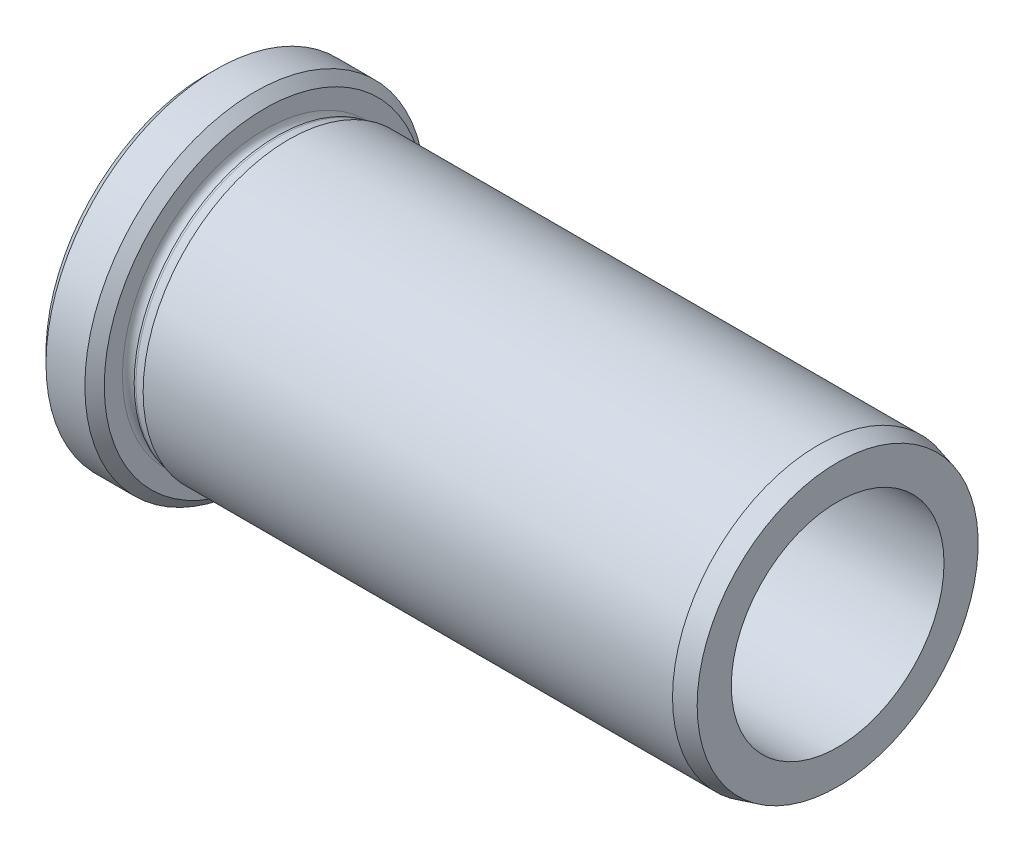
ISO-10303-21;
HEADER;
FILE_DESCRIPTION(('STEP AP214'),'2;1');
FILE_NAME('part.step','',(''),(''),'','','');
FILE_SCHEMA(('AUTOMOTIVE_DESIGN { 1 0 10303 214 1 1 1 1 }'));
ENDSEC;
DATA;
#1=APPLICATION_CONTEXT('core data for automotive mechanical design processes');
#2=APPLICATION_PROTOCOL_DEFINITION('international standard','automotive_design',2000,#1);
#3=PRODUCT_CONTEXT('',#1,'mechanical');
#4=PRODUCT('Part','Part','',(#3));
#5=PRODUCT_RELATED_PRODUCT_CATEGORY('part','',(#4));
#6=PRODUCT_DEFINITION_FORMATION('','',#4);
#7=PRODUCT_DEFINITION_CONTEXT('part definition',#1,'design');
#8=PRODUCT_DEFINITION('design','',#6,#7);
#9=PRODUCT_DEFINITION_SHAPE('','',#8);
#10=(LENGTH_UNIT() NAMED_UNIT(*) SI_UNIT(.MILLI.,.METRE.));
#11=(NAMED_UNIT(*) PLANE_ANGLE_UNIT() SI_UNIT($,.RADIAN.));
#12=(NAMED_UNIT(*) SI_UNIT($,.STERADIAN.) SOLID_ANGLE_UNIT());
#13=UNCERTAINTY_MEASURE_WITH_UNIT(LENGTH_MEASURE(1.E-05),#10,'distance_accuracy_value','');
#14=(GEOMETRIC_REPRESENTATION_CONTEXT(3) GLOBAL_UNCERTAINTY_ASSIGNED_CONTEXT((#13)) GLOBAL_UNIT_ASSIGNED_CONTEXT((#10,
#11,#12)) REPRESENTATION_CONTEXT('',''));
#15=CARTESIAN_POINT('',(0.,0.,0.));
#16=DIRECTION('',(0.,0.,1.));
#17=DIRECTION('',(1.,0.,0.));
#18=AXIS2_PLACEMENT_3D('',#15,#16,#17);
#19=CARTESIAN_POINT('',(30.9097582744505,10.95,0.));
#20=DIRECTION('',(1.,0.,0.));
#21=DIRECTION('',(0.,0.,-1.));
#22=AXIS2_PLACEMENT_3D('',#19,#20,#21);
#23=PLANE('',#22);
#24=CARTESIAN_POINT('',(30.9097582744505,0.,0.));
#25=DIRECTION('',(-1.,0.,0.));
#26=DIRECTION('',(0.,0.,1.));
#27=AXIS2_PLACEMENT_3D('',#24,#25,#26);
#28=CIRCLE('',#27,10.95);
#29=CARTESIAN_POINT('',(30.9097582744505,0.,10.95));
#30=VERTEX_POINT('',#29);
#31=EDGE_CURVE('E40',#30,#30,#28,.T.);
#32=ORIENTED_EDGE('',*,*,#31,.F.);
#33=EDGE_LOOP('',(#32));
#34=FACE_BOUND('',#33,.T.);
#35=CARTESIAN_POINT('',(30.9097582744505,0.,0.));
#36=DIRECTION('',(-1.,0.,0.));
#37=DIRECTION('',(0.,0.,1.));
#38=AXIS2_PLACEMENT_3D('',#35,#36,#37);
#39=CIRCLE('',#38,11.);
#40=CARTESIAN_POINT('',(30.9097582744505,0.,11.));
#41=VERTEX_POINT('',#40);
#42=EDGE_CURVE('E67',#41,#41,#39,.T.);
#43=ORIENTED_EDGE('',*,*,#42,.T.);
#44=EDGE_LOOP('',(#43));
#45=FACE_BOUND('',#44,.T.);
#46=ADVANCED_FACE('F14',(#34,#45),#23,.F.);
#47=CARTESIAN_POINT('',(0.,0.,0.));
#48=DIRECTION('',(-1.,0.,0.));
#49=DIRECTION('',(0.,0.,1.));
#50=AXIS2_PLACEMENT_3D('',#47,#48,#49);
#51=CYLINDRICAL_SURFACE('',#50,10.95);
#52=CARTESIAN_POINT('',(85.9097582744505,0.,0.));
#53=DIRECTION('',(-1.,0.,0.));
#54=DIRECTION('',(0.,0.,1.));
#55=AXIS2_PLACEMENT_3D('',#52,#53,#54);
#56=CIRCLE('',#55,10.95);
#57=CARTESIAN_POINT('',(85.9097582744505,0.,10.95));
#58=VERTEX_POINT('',#57);
#59=EDGE_CURVE('E43',#58,#58,#56,.T.);
#60=ORIENTED_EDGE('',*,*,#59,.F.);
#61=EDGE_LOOP('',(#60));
#62=FACE_BOUND('',#61,.T.);
#63=ORIENTED_EDGE('',*,*,#31,.T.);
#64=EDGE_LOOP('',(#63));
#65=FACE_BOUND('',#64,.T.);
#66=ADVANCED_FACE('F91',(#62,#65),#51,.F.);
#67=CARTESIAN_POINT('',(85.9097582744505,14.4641016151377,0.));
#68=DIRECTION('',(-1.,0.,0.));
#69=DIRECTION('',(0.,0.,1.));
#70=AXIS2_PLACEMENT_3D('',#67,#68,#69);
#71=PLANE('',#70);
#72=CARTESIAN_POINT('',(85.9097582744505,0.,0.));
#73=DIRECTION('',(-1.,0.,0.));
#74=DIRECTION('',(0.,0.,1.));
#75=AXIS2_PLACEMENT_3D('',#72,#73,#74);
#76=CIRCLE('',#75,14.4641016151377);
#77=CARTESIAN_POINT('',(85.9097582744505,0.,14.4641016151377));
#78=VERTEX_POINT('',#77);
#79=EDGE_CURVE('E46',#78,#78,#76,.T.);
#80=ORIENTED_EDGE('',*,*,#79,.F.);
#81=EDGE_LOOP('',(#80));
#82=FACE_BOUND('',#81,.T.);
#83=ORIENTED_EDGE('',*,*,#59,.T.);
#84=EDGE_LOOP('',(#83));
#85=FACE_BOUND('',#84,.T.);
#86=ADVANCED_FACE('F98',(#82,#85),#71,.F.);
#87=CARTESIAN_POINT('',(85.9097582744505,0.,0.));
#88=DIRECTION('',(-1.,0.,0.));
#89=DIRECTION('',(0.,0.,1.));
#90=AXIS2_PLACEMENT_3D('',#87,#88,#89);
#91=CONICAL_SURFACE('',#90,14.4641016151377,0.261799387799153);
#92=CARTESIAN_POINT('',(83.9097582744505,0.,0.));
#93=DIRECTION('',(-1.,0.,0.));
#94=DIRECTION('',(0.,0.,1.));
#95=AXIS2_PLACEMENT_3D('',#92,#93,#94);
#96=CIRCLE('',#95,15.);
#97=CARTESIAN_POINT('',(83.9097582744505,0.,15.));
#98=VERTEX_POINT('',#97);
#99=EDGE_CURVE('E49',#98,#98,#96,.T.);
#100=ORIENTED_EDGE('',*,*,#99,.F.);
#101=EDGE_LOOP('',(#100));
#102=FACE_BOUND('',#101,.T.);
#103=ORIENTED_EDGE('',*,*,#79,.T.);
#104=EDGE_LOOP('',(#103));
#105=FACE_BOUND('',#104,.T.);
#106=ADVANCED_FACE('F196',(#102,#105),#91,.T.);
#107=CARTESIAN_POINT('',(0.,0.,0.));
#108=DIRECTION('',(-1.,0.,0.));
#109=DIRECTION('',(0.,0.,1.));
#110=AXIS2_PLACEMENT_3D('',#107,#108,#109);
#111=CYLINDRICAL_SURFACE('',#110,15.);
#112=CARTESIAN_POINT('',(29.4097582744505,0.,0.));
#113=DIRECTION('',(-1.,0.,0.));
#114=DIRECTION('',(0.,0.,1.));
#115=AXIS2_PLACEMENT_3D('',#112,#113,#114);
#116=CIRCLE('',#115,15.);
#117=CARTESIAN_POINT('',(29.4097582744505,0.,15.));
#118=VERTEX_POINT('',#117);
#119=EDGE_CURVE('E52',#118,#118,#116,.T.);
#120=ORIENTED_EDGE('',*,*,#119,.F.);
#121=EDGE_LOOP('',(#120));
#122=FACE_BOUND('',#121,.T.);
#123=ORIENTED_EDGE('',*,*,#99,.T.);
#124=EDGE_LOOP('',(#123));
#125=FACE_BOUND('',#124,.T.);
#126=ADVANCED_FACE('F186',(#122,#125),#111,.T.);
#127=CARTESIAN_POINT('',(29.4097582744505,0.,0.));
#128=DIRECTION('',(1.,0.,0.));
#129=DIRECTION('',(0.,0.,-1.));
#130=AXIS2_PLACEMENT_3D('',#127,#128,#129);
#131=CONICAL_SURFACE('',#130,15.,0.261799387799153);
#132=CARTESIAN_POINT('',(28.3918762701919,0.,0.));
#133=DIRECTION('',(-1.,0.,0.));
#134=DIRECTION('',(0.,0.,1.));
#135=AXIS2_PLACEMENT_3D('',#132,#133,#134);
#136=CIRCLE('',#135,14.7272593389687);
#137=CARTESIAN_POINT('',(28.3918762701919,0.,14.7272593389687));
#138=VERTEX_POINT('',#137);
#139=EDGE_CURVE('E55',#138,#138,#136,.T.);
#140=ORIENTED_EDGE('',*,*,#139,.F.);
#141=EDGE_LOOP('',(#140));
#142=FACE_BOUND('',#141,.T.);
#143=ORIENTED_EDGE('',*,*,#119,.T.);
#144=EDGE_LOOP('',(#143));
#145=FACE_BOUND('',#144,.T.);
#146=ADVANCED_FACE('F176',(#142,#145),#131,.T.);
#147=CARTESIAN_POINT('',(28.1848210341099,0.,0.));
#148=DIRECTION('',(-1.,0.,0.));
#149=DIRECTION('',(0.,0.,1.));
#150=AXIS2_PLACEMENT_3D('',#147,#148,#149);
#151=TOROIDAL_SURFACE('',#150,15.5,0.8);
#152=CARTESIAN_POINT('',(28.1848210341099,0.,0.));
#153=DIRECTION('',(-1.,0.,0.));
#154=DIRECTION('',(0.,0.,1.));
#155=AXIS2_PLACEMENT_3D('',#152,#153,#154);
#156=CIRCLE('',#155,14.7);
#157=CARTESIAN_POINT('',(28.1848210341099,0.,14.7));
#158=VERTEX_POINT('',#157);
#159=EDGE_CURVE('E58',#158,#158,#156,.T.);
#160=ORIENTED_EDGE('',*,*,#159,.F.);
#161=EDGE_LOOP('',(#160));
#162=FACE_BOUND('',#161,.T.);
#163=ORIENTED_EDGE('',*,*,#139,.T.);
#164=EDGE_LOOP('',(#163));
#165=FACE_BOUND('',#164,.T.);
#166=ADVANCED_FACE('F166',(#162,#165),#151,.F.);
#167=CARTESIAN_POINT('',(0.,0.,0.));
#168=DIRECTION('',(-1.,0.,0.));
#169=DIRECTION('',(0.,0.,1.));
#170=AXIS2_PLACEMENT_3D('',#167,#168,#169);
#171=CYLINDRICAL_SURFACE('',#170,14.7);
#172=CARTESIAN_POINT('',(28.5066259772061,0.,0.));
#173=DIRECTION('',(-1.,0.,0.));
#174=DIRECTION('',(0.,0.,1.));
#175=AXIS2_PLACEMENT_3D('',#172,#173,#174);
#176=CIRCLE('',#175,14.7);
#177=CARTESIAN_POINT('',(28.5066259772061,0.,14.7));
#178=VERTEX_POINT('',#177);
#179=EDGE_CURVE('E61',#178,#178,#176,.T.);
#180=ORIENTED_EDGE('',*,*,#179,.F.);
#181=EDGE_LOOP('',(#180));
#182=FACE_BOUND('',#181,.T.);
#183=ORIENTED_EDGE('',*,*,#159,.T.);
#184=EDGE_LOOP('',(#183));
#185=FACE_BOUND('',#184,.T.);
#186=ADVANCED_FACE('F156',(#182,#185),#171,.F.);
#187=CARTESIAN_POINT('',(27.7097582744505,0.,0.));
#188=DIRECTION('',(-1.,0.,0.));
#189=DIRECTION('',(0.,0.,1.));
#190=AXIS2_PLACEMENT_3D('',#187,#188,#189);
#191=TOROIDAL_SURFACE('',#190,14.6292761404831,0.8);
#192=CARTESIAN_POINT('',(26.9097582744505,0.,0.));
#193=DIRECTION('',(-1.,0.,0.));
#194=DIRECTION('',(0.,0.,1.));
#195=AXIS2_PLACEMENT_3D('',#192,#193,#194);
#196=CIRCLE('',#195,14.6292761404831);
#197=CARTESIAN_POINT('',(26.9097582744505,0.,14.6292761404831));
#198=VERTEX_POINT('',#197);
#199=EDGE_CURVE('E64',#198,#198,#196,.T.);
#200=ORIENTED_EDGE('',*,*,#199,.F.);
#201=EDGE_LOOP('',(#200));
#202=FACE_BOUND('',#201,.T.);
#203=ORIENTED_EDGE('',*,*,#179,.T.);
#204=EDGE_LOOP('',(#203));
#205=FACE_BOUND('',#204,.T.);
#206=ADVANCED_FACE('F147',(#202,#205),#191,.F.);
#207=CARTESIAN_POINT('',(26.9097582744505,17.5,0.));
#208=DIRECTION('',(-1.,0.,0.));
#209=DIRECTION('',(0.,0.,1.));
#210=AXIS2_PLACEMENT_3D('',#207,#208,#209);
#211=PLANE('',#210);
#212=CARTESIAN_POINT('',(26.9097582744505,0.,0.));
#213=DIRECTION('',(-1.,0.,0.));
#214=DIRECTION('',(0.,0.,1.));
#215=AXIS2_PLACEMENT_3D('',#212,#213,#214);
#216=CIRCLE('',#215,16.5);
#217=CARTESIAN_POINT('',(26.9097582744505,0.,16.5));
#218=VERTEX_POINT('',#217);
#219=EDGE_CURVE('E9',#218,#218,#216,.F.);
#220=ORIENTED_EDGE('',*,*,#219,.T.);
#221=EDGE_LOOP('',(#220));
#222=FACE_BOUND('',#221,.T.);
#223=ORIENTED_EDGE('',*,*,#199,.T.);
#224=EDGE_LOOP('',(#223));
#225=FACE_BOUND('',#224,.T.);
#226=ADVANCED_FACE('F137',(#222,#225),#211,.F.);
#227=CARTESIAN_POINT('',(0.,0.,0.));
#228=DIRECTION('',(-1.,0.,0.));
#229=DIRECTION('',(0.,0.,1.));
#230=AXIS2_PLACEMENT_3D('',#227,#228,#229);
#231=CYLINDRICAL_SURFACE('',#230,17.5);
#232=CARTESIAN_POINT('',(25.9097582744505,0.,0.));
#233=DIRECTION('',(-1.,0.,0.));
#234=DIRECTION('',(0.,0.,1.));
#235=AXIS2_PLACEMENT_3D('',#232,#233,#234);
#236=CIRCLE('',#235,17.5);
#237=CARTESIAN_POINT('',(25.9097582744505,0.,17.5));
#238=VERTEX_POINT('',#237);
#239=EDGE_CURVE('E21',#238,#238,#236,.T.);
#240=ORIENTED_EDGE('',*,*,#239,.T.);
#241=EDGE_LOOP('',(#240));
#242=FACE_BOUND('',#241,.T.);
#243=CARTESIAN_POINT('',(21.9097582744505,0.,0.));
#244=DIRECTION('',(1.,0.,0.));
#245=DIRECTION('',(0.,0.,-1.));
#246=AXIS2_PLACEMENT_3D('',#243,#244,#245);
#247=CIRCLE('',#246,17.5);
#248=CARTESIAN_POINT('',(21.9097582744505,0.,-17.5));
#249=VERTEX_POINT('',#248);
#250=EDGE_CURVE('E34',#249,#249,#247,.T.);
#251=ORIENTED_EDGE('',*,*,#250,.T.);
#252=EDGE_LOOP('',(#251));
#253=FACE_BOUND('',#252,.T.);
#254=ADVANCED_FACE('F87',(#242,#253),#231,.T.);
#255=CARTESIAN_POINT('',(20.9097582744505,17.5,0.));
#256=DIRECTION('',(1.,0.,0.));
#257=DIRECTION('',(0.,0.,-1.));
#258=AXIS2_PLACEMENT_3D('',#255,#256,#257);
#259=PLANE('',#258);
#260=CARTESIAN_POINT('',(20.9097582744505,0.,0.));
#261=DIRECTION('',(1.,0.,0.));
#262=DIRECTION('',(0.,0.,-1.));
#263=AXIS2_PLACEMENT_3D('',#260,#261,#262);
#264=CIRCLE('',#263,12.5);
#265=CARTESIAN_POINT('',(20.9097582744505,0.,-12.5));
#266=VERTEX_POINT('',#265);
#267=EDGE_CURVE('E25',#266,#266,#264,.T.);
#268=ORIENTED_EDGE('',*,*,#267,.T.);
#269=EDGE_LOOP('',(#268));
#270=FACE_BOUND('',#269,.T.);
#271=CARTESIAN_POINT('',(20.9097582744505,0.,0.));
#272=DIRECTION('',(1.,0.,0.));
#273=DIRECTION('',(0.,0.,-1.));
#274=AXIS2_PLACEMENT_3D('',#271,#272,#273);
#275=CIRCLE('',#274,16.5);
#276=CARTESIAN_POINT('',(20.9097582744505,0.,-16.5));
#277=VERTEX_POINT('',#276);
#278=EDGE_CURVE('E37',#277,#277,#275,.F.);
#279=ORIENTED_EDGE('',*,*,#278,.T.);
#280=EDGE_LOOP('',(#279));
#281=FACE_BOUND('',#280,.T.);
#282=ADVANCED_FACE('F75',(#270,#281),#259,.F.);
#283=CARTESIAN_POINT('',(0.,0.,0.));
#284=DIRECTION('',(-1.,0.,0.));
#285=DIRECTION('',(0.,0.,1.));
#286=AXIS2_PLACEMENT_3D('',#283,#284,#285);
#287=CYLINDRICAL_SURFACE('',#286,11.);
#288=CARTESIAN_POINT('',(22.4097582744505,0.,0.));
#289=DIRECTION('',(1.,0.,0.));
#290=DIRECTION('',(0.,0.,-1.));
#291=AXIS2_PLACEMENT_3D('',#288,#289,#290);
#292=CIRCLE('',#291,11.);
#293=CARTESIAN_POINT('',(22.4097582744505,0.,-11.));
#294=VERTEX_POINT('',#293);
#295=EDGE_CURVE('E29',#294,#294,#292,.F.);
#296=ORIENTED_EDGE('',*,*,#295,.T.);
#297=EDGE_LOOP('',(#296));
#298=FACE_BOUND('',#297,.T.);
#299=ORIENTED_EDGE('',*,*,#42,.F.);
#300=EDGE_LOOP('',(#299));
#301=FACE_BOUND('',#300,.T.);
#302=ADVANCED_FACE('F72',(#298,#301),#287,.F.);
#303=CARTESIAN_POINT('',(20.9097582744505,0.,0.));
#304=DIRECTION('',(1.,0.,0.));
#305=DIRECTION('',(0.,0.,-1.));
#306=AXIS2_PLACEMENT_3D('',#303,#304,#305);
#307=CONICAL_SURFACE('',#306,16.5,0.785398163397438);
#308=ORIENTED_EDGE('',*,*,#250,.F.);
#309=EDGE_LOOP('',(#308));
#310=FACE_BOUND('',#309,.T.);
#311=ORIENTED_EDGE('',*,*,#278,.F.);
#312=EDGE_LOOP('',(#311));
#313=FACE_BOUND('',#312,.T.);
#314=ADVANCED_FACE('F74',(#310,#313),#307,.T.);
#315=CARTESIAN_POINT('',(22.4097582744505,0.,0.));
#316=DIRECTION('',(1.,0.,0.));
#317=DIRECTION('',(0.,0.,-1.));
#318=AXIS2_PLACEMENT_3D('',#315,#316,#317);
#319=TOROIDAL_SURFACE('',#318,12.5,1.5);
#320=ORIENTED_EDGE('',*,*,#267,.F.);
#321=EDGE_LOOP('',(#320));
#322=FACE_BOUND('',#321,.T.);
#323=ORIENTED_EDGE('',*,*,#295,.F.);
#324=EDGE_LOOP('',(#323));
#325=FACE_BOUND('',#324,.T.);
#326=ADVANCED_FACE('F84',(#322,#325),#319,.T.);
#327=CARTESIAN_POINT('',(25.9097582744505,0.,0.));
#328=DIRECTION('',(-1.,0.,0.));
#329=DIRECTION('',(0.,0.,1.));
#330=AXIS2_PLACEMENT_3D('',#327,#328,#329);
#331=CONICAL_SURFACE('',#330,17.5,0.785398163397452);
#332=ORIENTED_EDGE('',*,*,#219,.F.);
#333=EDGE_LOOP('',(#332));
#334=FACE_BOUND('',#333,.T.);
#335=ORIENTED_EDGE('',*,*,#239,.F.);
#336=EDGE_LOOP('',(#335));
#337=FACE_BOUND('',#336,.T.);
#338=ADVANCED_FACE('F16',(#334,#337),#331,.T.);
#339=CLOSED_SHELL('',(#46,#66,#86,#106,#126,#146,#166,#186,#206,#226,#254,#282,#302,#314,#326,#338));
#340=MANIFOLD_SOLID_BREP('B1',#339);
#341=ADVANCED_BREP_SHAPE_REPRESENTATION('',(#18,#340),#14);
#342=SHAPE_DEFINITION_REPRESENTATION(#9,#341);
ENDSEC;
END-ISO-10303-21;
